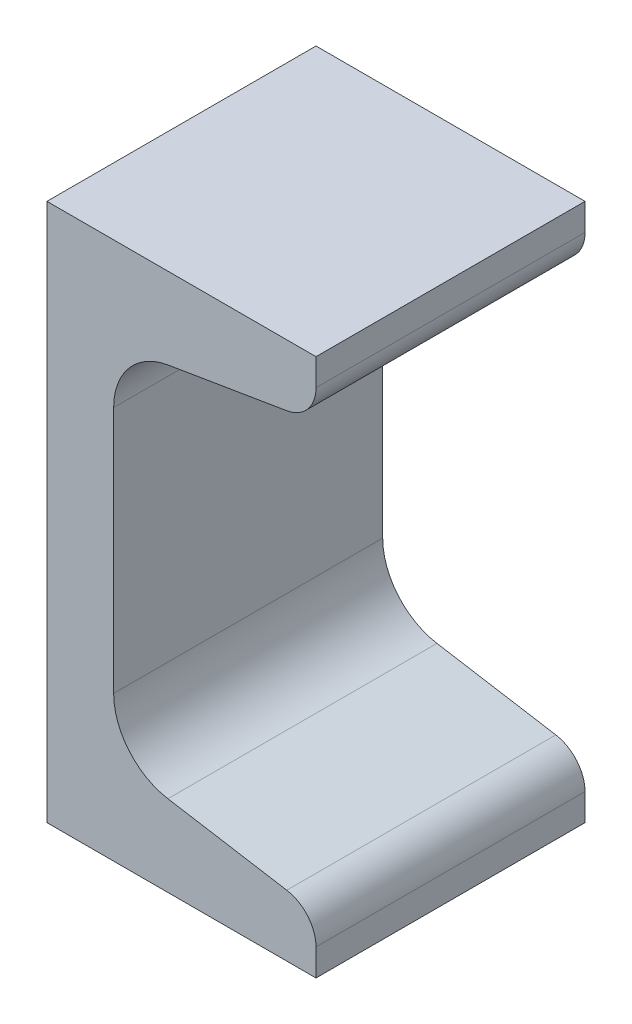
from build123d import *

# Parameters (mm, degrees)
BASEALUMCHANNEL_DEPTH = 12.7


with BuildPart() as part:
    # Sketch1 → BaseAlumChannel (new, symmetric)
    with BuildSketch(Plane.XY):
        with BuildLine():
            Line((0, 0), (0, 50.8))
            Line((0, 50.8), (25.4, 50.8))
            Line((25.4, 50.8), (25.4, 48.26))
            ThreePointArc((25.4, 48.26), (24.617504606, 46.125684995), (22.640883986, 45.002933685))
            Line((22.640883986, 45.002933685), (11.419617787, 43.13258622))
            ThreePointArc((11.419617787, 43.13258622), (7.749445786, 41.047871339), (6.296515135, 37.084893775))
            Line((6.296515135, 37.084893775), (6.296515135, 13.715106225))
            ThreePointArc((6.296515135, 13.715106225), (7.749445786, 9.752128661), (11.419617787, 7.66741378))
            Line((11.419617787, 7.66741378), (22.640883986, 5.797066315))
            ThreePointArc((22.640883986, 5.797066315), (24.617504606, 4.674315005), (25.4, 2.54))
            Line((25.4, 2.54), (25.4, 0))
            Line((25.4, 0), (0, 0))
        make_face()
    extrude(amount=BASEALUMCHANNEL_DEPTH, both=True)


solid = part.part
